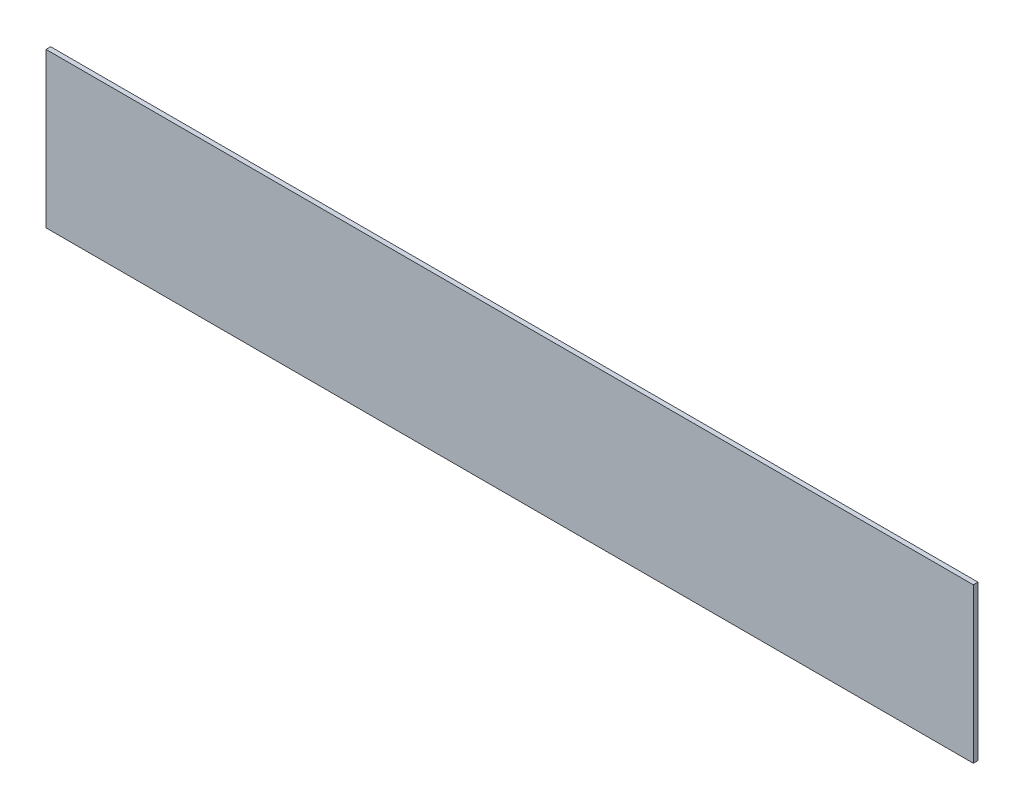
ISO-10303-21;
HEADER;
FILE_DESCRIPTION(('STEP AP214'),'2;1');
FILE_NAME('part.step','',(''),(''),'','','');
FILE_SCHEMA(('AUTOMOTIVE_DESIGN { 1 0 10303 214 1 1 1 1 }'));
ENDSEC;
DATA;
#1=APPLICATION_CONTEXT('core data for automotive mechanical design processes');
#2=APPLICATION_PROTOCOL_DEFINITION('international standard','automotive_design',2000,#1);
#3=PRODUCT_CONTEXT('',#1,'mechanical');
#4=PRODUCT('Part','Part','',(#3));
#5=PRODUCT_RELATED_PRODUCT_CATEGORY('part','',(#4));
#6=PRODUCT_DEFINITION_FORMATION('','',#4);
#7=PRODUCT_DEFINITION_CONTEXT('part definition',#1,'design');
#8=PRODUCT_DEFINITION('design','',#6,#7);
#9=PRODUCT_DEFINITION_SHAPE('','',#8);
#10=(LENGTH_UNIT() NAMED_UNIT(*) SI_UNIT(.MILLI.,.METRE.));
#11=(NAMED_UNIT(*) PLANE_ANGLE_UNIT() SI_UNIT($,.RADIAN.));
#12=(NAMED_UNIT(*) SI_UNIT($,.STERADIAN.) SOLID_ANGLE_UNIT());
#13=UNCERTAINTY_MEASURE_WITH_UNIT(LENGTH_MEASURE(1.E-05),#10,'distance_accuracy_value','');
#14=(GEOMETRIC_REPRESENTATION_CONTEXT(3) GLOBAL_UNCERTAINTY_ASSIGNED_CONTEXT((#13)) GLOBAL_UNIT_ASSIGNED_CONTEXT((#10,
#11,#12)) REPRESENTATION_CONTEXT('',''));
#15=CARTESIAN_POINT('',(0.,0.,0.));
#16=DIRECTION('',(0.,0.,1.));
#17=DIRECTION('',(1.,0.,0.));
#18=AXIS2_PLACEMENT_3D('',#15,#16,#17);
#19=CARTESIAN_POINT('',(-30.,5.,0.300000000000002));
#20=DIRECTION('',(1.,0.,0.));
#21=DIRECTION('',(0.,0.,-1.));
#22=AXIS2_PLACEMENT_3D('',#19,#20,#21);
#23=PLANE('',#22);
#24=DIRECTION('',(0.,-1.,0.));
#25=VECTOR('',#24,1.);
#26=CARTESIAN_POINT('',(-30.,5.,0.));
#27=LINE('',#26,#25);
#28=CARTESIAN_POINT('',(-30.,5.,0.));
#29=VERTEX_POINT('',#28);
#30=CARTESIAN_POINT('',(-30.,-5.,0.));
#31=VERTEX_POINT('',#30);
#32=EDGE_CURVE('E70',#29,#31,#27,.T.);
#33=ORIENTED_EDGE('',*,*,#32,.T.);
#34=DIRECTION('',(0.,0.,-1.));
#35=VECTOR('',#34,1.);
#36=CARTESIAN_POINT('',(-30.,-5.,0.300000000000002));
#37=LINE('',#36,#35);
#38=CARTESIAN_POINT('',(-30.,-5.,0.300000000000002));
#39=VERTEX_POINT('',#38);
#40=EDGE_CURVE('E11',#39,#31,#37,.T.);
#41=ORIENTED_EDGE('',*,*,#40,.F.);
#42=DIRECTION('',(0.,-1.,0.));
#43=VECTOR('',#42,1.);
#44=CARTESIAN_POINT('',(-30.,5.,0.300000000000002));
#45=LINE('',#44,#43);
#46=CARTESIAN_POINT('',(-30.,5.,0.300000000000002));
#47=VERTEX_POINT('',#46);
#48=EDGE_CURVE('E88',#47,#39,#45,.T.);
#49=ORIENTED_EDGE('',*,*,#48,.F.);
#50=DIRECTION('',(0.,0.,-1.));
#51=VECTOR('',#50,1.);
#52=CARTESIAN_POINT('',(-30.,5.,0.300000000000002));
#53=LINE('',#52,#51);
#54=EDGE_CURVE('E82',#47,#29,#53,.T.);
#55=ORIENTED_EDGE('',*,*,#54,.T.);
#56=EDGE_LOOP('',(#33,#41,#49,#55));
#57=FACE_BOUND('',#56,.T.);
#58=ADVANCED_FACE('F26',(#57),#23,.F.);
#59=CARTESIAN_POINT('',(-30.,-5.,0.300000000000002));
#60=DIRECTION('',(0.,1.,0.));
#61=DIRECTION('',(0.,0.,1.));
#62=AXIS2_PLACEMENT_3D('',#59,#60,#61);
#63=PLANE('',#62);
#64=DIRECTION('',(1.,0.,0.));
#65=VECTOR('',#64,1.);
#66=CARTESIAN_POINT('',(-30.,-5.,0.));
#67=LINE('',#66,#65);
#68=CARTESIAN_POINT('',(30.,-5.,0.));
#69=VERTEX_POINT('',#68);
#70=EDGE_CURVE('E66',#31,#69,#67,.T.);
#71=ORIENTED_EDGE('',*,*,#70,.T.);
#72=DIRECTION('',(0.,0.,-1.));
#73=VECTOR('',#72,1.);
#74=CARTESIAN_POINT('',(30.,-5.,0.300000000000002));
#75=LINE('',#74,#73);
#76=CARTESIAN_POINT('',(30.,-5.,0.300000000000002));
#77=VERTEX_POINT('',#76);
#78=EDGE_CURVE('E33',#77,#69,#75,.T.);
#79=ORIENTED_EDGE('',*,*,#78,.F.);
#80=DIRECTION('',(1.,0.,0.));
#81=VECTOR('',#80,1.);
#82=CARTESIAN_POINT('',(-30.,-5.,0.300000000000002));
#83=LINE('',#82,#81);
#84=EDGE_CURVE('E78',#39,#77,#83,.T.);
#85=ORIENTED_EDGE('',*,*,#84,.F.);
#86=ORIENTED_EDGE('',*,*,#40,.T.);
#87=EDGE_LOOP('',(#71,#79,#85,#86));
#88=FACE_BOUND('',#87,.T.);
#89=ADVANCED_FACE('F77',(#88),#63,.F.);
#90=CARTESIAN_POINT('',(30.,5.,0.300000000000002));
#91=DIRECTION('',(-1.,0.,0.));
#92=DIRECTION('',(0.,0.,1.));
#93=AXIS2_PLACEMENT_3D('',#90,#91,#92);
#94=PLANE('',#93);
#95=DIRECTION('',(0.,1.,0.));
#96=VECTOR('',#95,1.);
#97=CARTESIAN_POINT('',(30.,5.,0.));
#98=LINE('',#97,#96);
#99=CARTESIAN_POINT('',(30.,5.,0.));
#100=VERTEX_POINT('',#99);
#101=EDGE_CURVE('E71',#69,#100,#98,.T.);
#102=ORIENTED_EDGE('',*,*,#101,.T.);
#103=DIRECTION('',(0.,0.,-1.));
#104=VECTOR('',#103,1.);
#105=CARTESIAN_POINT('',(30.,5.,0.300000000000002));
#106=LINE('',#105,#104);
#107=CARTESIAN_POINT('',(30.,5.,0.300000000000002));
#108=VERTEX_POINT('',#107);
#109=EDGE_CURVE('E94',#108,#100,#106,.T.);
#110=ORIENTED_EDGE('',*,*,#109,.F.);
#111=DIRECTION('',(0.,1.,0.));
#112=VECTOR('',#111,1.);
#113=CARTESIAN_POINT('',(30.,5.,0.300000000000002));
#114=LINE('',#113,#112);
#115=EDGE_CURVE('E45',#77,#108,#114,.T.);
#116=ORIENTED_EDGE('',*,*,#115,.F.);
#117=ORIENTED_EDGE('',*,*,#78,.T.);
#118=EDGE_LOOP('',(#102,#110,#116,#117));
#119=FACE_BOUND('',#118,.T.);
#120=ADVANCED_FACE('F97',(#119),#94,.F.);
#121=CARTESIAN_POINT('',(-30.,5.,0.300000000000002));
#122=DIRECTION('',(0.,-1.,0.));
#123=DIRECTION('',(0.,0.,-1.));
#124=AXIS2_PLACEMENT_3D('',#121,#122,#123);
#125=PLANE('',#124);
#126=DIRECTION('',(-1.,0.,0.));
#127=VECTOR('',#126,1.);
#128=CARTESIAN_POINT('',(-30.,5.,0.));
#129=LINE('',#128,#127);
#130=EDGE_CURVE('E86',#100,#29,#129,.T.);
#131=ORIENTED_EDGE('',*,*,#130,.T.);
#132=ORIENTED_EDGE('',*,*,#54,.F.);
#133=DIRECTION('',(-1.,0.,0.));
#134=VECTOR('',#133,1.);
#135=CARTESIAN_POINT('',(-30.,5.,0.300000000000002));
#136=LINE('',#135,#134);
#137=EDGE_CURVE('E40',#108,#47,#136,.T.);
#138=ORIENTED_EDGE('',*,*,#137,.F.);
#139=ORIENTED_EDGE('',*,*,#109,.T.);
#140=EDGE_LOOP('',(#131,#132,#138,#139));
#141=FACE_BOUND('',#140,.T.);
#142=ADVANCED_FACE('F99',(#141),#125,.F.);
#143=CARTESIAN_POINT('',(-30.,-5.,0.300000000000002));
#144=DIRECTION('',(0.,0.,1.));
#145=DIRECTION('',(1.,0.,0.));
#146=AXIS2_PLACEMENT_3D('',#143,#144,#145);
#147=PLANE('',#146);
#148=ORIENTED_EDGE('',*,*,#48,.T.);
#149=ORIENTED_EDGE('',*,*,#84,.T.);
#150=ORIENTED_EDGE('',*,*,#115,.T.);
#151=ORIENTED_EDGE('',*,*,#137,.T.);
#152=EDGE_LOOP('',(#148,#149,#150,#151));
#153=FACE_BOUND('',#152,.T.);
#154=ADVANCED_FACE('F100',(#153),#147,.T.);
#155=CARTESIAN_POINT('',(-30.,-5.,0.));
#156=DIRECTION('',(0.,0.,1.));
#157=DIRECTION('',(1.,0.,0.));
#158=AXIS2_PLACEMENT_3D('',#155,#156,#157);
#159=PLANE('',#158);
#160=ORIENTED_EDGE('',*,*,#32,.F.);
#161=ORIENTED_EDGE('',*,*,#130,.F.);
#162=ORIENTED_EDGE('',*,*,#101,.F.);
#163=ORIENTED_EDGE('',*,*,#70,.F.);
#164=EDGE_LOOP('',(#160,#161,#162,#163));
#165=FACE_BOUND('',#164,.T.);
#166=ADVANCED_FACE('F67',(#165),#159,.F.);
#167=CLOSED_SHELL('',(#58,#89,#120,#142,#154,#166));
#168=MANIFOLD_SOLID_BREP('B2',#167);
#169=ADVANCED_BREP_SHAPE_REPRESENTATION('',(#18,#168),#14);
#170=SHAPE_DEFINITION_REPRESENTATION(#9,#169);
ENDSEC;
END-ISO-10303-21;
